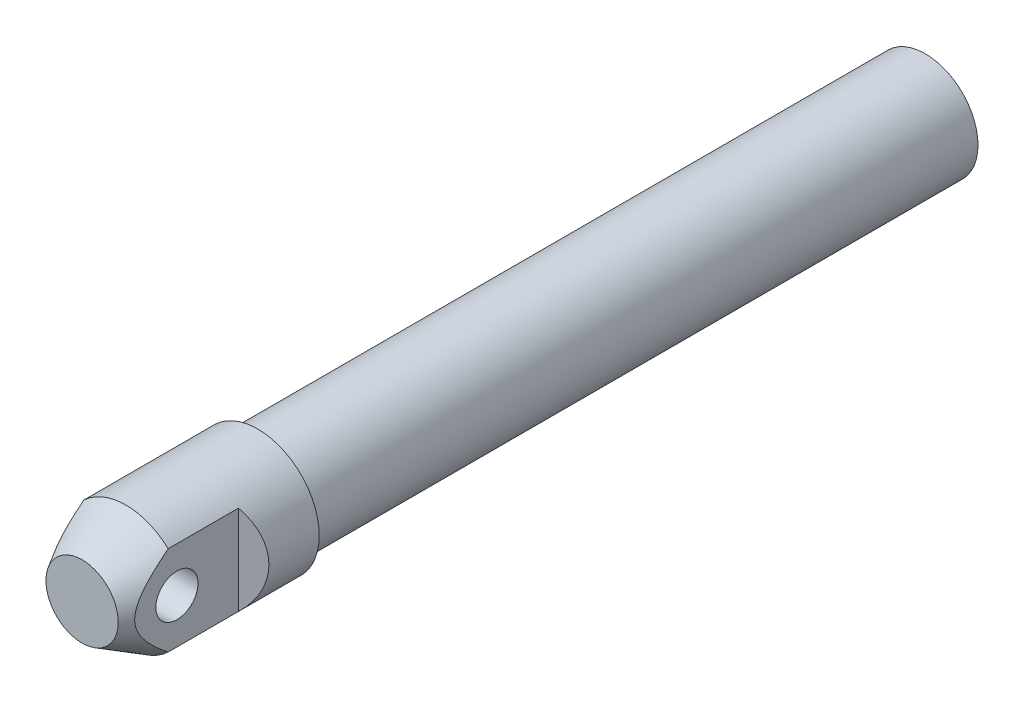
ISO-10303-21;
HEADER;
FILE_DESCRIPTION(('STEP AP214'),'2;1');
FILE_NAME('part.step','',(''),(''),'','','');
FILE_SCHEMA(('AUTOMOTIVE_DESIGN { 1 0 10303 214 1 1 1 1 }'));
ENDSEC;
DATA;
#1=APPLICATION_CONTEXT('core data for automotive mechanical design processes');
#2=APPLICATION_PROTOCOL_DEFINITION('international standard','automotive_design',2000,#1);
#3=PRODUCT_CONTEXT('',#1,'mechanical');
#4=PRODUCT('Part','Part','',(#3));
#5=PRODUCT_RELATED_PRODUCT_CATEGORY('part','',(#4));
#6=PRODUCT_DEFINITION_FORMATION('','',#4);
#7=PRODUCT_DEFINITION_CONTEXT('part definition',#1,'design');
#8=PRODUCT_DEFINITION('design','',#6,#7);
#9=PRODUCT_DEFINITION_SHAPE('','',#8);
#10=(LENGTH_UNIT() NAMED_UNIT(*) SI_UNIT(.MILLI.,.METRE.));
#11=(NAMED_UNIT(*) PLANE_ANGLE_UNIT() SI_UNIT($,.RADIAN.));
#12=(NAMED_UNIT(*) SI_UNIT($,.STERADIAN.) SOLID_ANGLE_UNIT());
#13=UNCERTAINTY_MEASURE_WITH_UNIT(LENGTH_MEASURE(1.E-05),#10,'distance_accuracy_value','');
#14=(GEOMETRIC_REPRESENTATION_CONTEXT(3) GLOBAL_UNCERTAINTY_ASSIGNED_CONTEXT((#13)) GLOBAL_UNIT_ASSIGNED_CONTEXT((#10,
#11,#12)) REPRESENTATION_CONTEXT('',''));
#15=CARTESIAN_POINT('',(0.,0.,0.));
#16=DIRECTION('',(0.,0.,1.));
#17=DIRECTION('',(1.,0.,0.));
#18=AXIS2_PLACEMENT_3D('',#15,#16,#17);
#19=CARTESIAN_POINT('',(0.,0.,20.));
#20=DIRECTION('',(0.,0.,1.));
#21=DIRECTION('',(1.,0.,0.));
#22=AXIS2_PLACEMENT_3D('',#19,#20,#21);
#23=CYLINDRICAL_SURFACE('',#22,3.5);
#24=CARTESIAN_POINT('',(0.,0.,0.));
#25=DIRECTION('',(0.,0.,1.));
#26=DIRECTION('',(1.,0.,0.));
#27=AXIS2_PLACEMENT_3D('',#24,#25,#26);
#28=CIRCLE('',#27,3.5);
#29=CARTESIAN_POINT('',(3.5,0.,0.));
#30=VERTEX_POINT('',#29);
#31=EDGE_CURVE('E82',#30,#30,#28,.T.);
#32=ORIENTED_EDGE('',*,*,#31,.T.);
#33=EDGE_LOOP('',(#32));
#34=FACE_BOUND('',#33,.T.);
#35=CARTESIAN_POINT('',(0.,0.,7.5));
#36=DIRECTION('',(0.,0.,1.));
#37=DIRECTION('',(1.,0.,0.));
#38=AXIS2_PLACEMENT_3D('',#35,#36,#37);
#39=CIRCLE('',#38,3.5);
#40=CARTESIAN_POINT('',(-2.4,-2.5475478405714,7.5));
#41=VERTEX_POINT('',#40);
#42=CARTESIAN_POINT('',(2.4,-2.54754784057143,7.5));
#43=VERTEX_POINT('',#42);
#44=EDGE_CURVE('E67',#41,#43,#39,.T.);
#45=ORIENTED_EDGE('',*,*,#44,.F.);
#46=DIRECTION('',(0.,0.,1.));
#47=VECTOR('',#46,1.);
#48=CARTESIAN_POINT('',(-2.4,-2.5475478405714,20.));
#49=LINE('',#48,#47);
#50=CARTESIAN_POINT('',(-2.4,-2.5475478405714,3.5));
#51=VERTEX_POINT('',#50);
#52=EDGE_CURVE('E30',#41,#51,#49,.F.);
#53=ORIENTED_EDGE('',*,*,#52,.T.);
#54=CARTESIAN_POINT('',(0.,0.,4.8856406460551));
#55=DIRECTION('',(0.5,0.,-0.866025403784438));
#56=DIRECTION('',(0.866025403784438,0.,0.5));
#57=AXIS2_PLACEMENT_3D('',#54,#55,#56);
#58=ELLIPSE('',#57,4.04145188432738,3.5);
#59=CARTESIAN_POINT('',(-2.4,2.5475478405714,3.5));
#60=VERTEX_POINT('',#59);
#61=EDGE_CURVE('E9',#60,#51,#58,.F.);
#62=ORIENTED_EDGE('',*,*,#61,.F.);
#63=DIRECTION('',(0.,0.,1.));
#64=VECTOR('',#63,1.);
#65=CARTESIAN_POINT('',(-2.4,2.5475478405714,20.));
#66=LINE('',#65,#64);
#67=CARTESIAN_POINT('',(-2.4,2.5475478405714,7.5));
#68=VERTEX_POINT('',#67);
#69=EDGE_CURVE('E63',#60,#68,#66,.T.);
#70=ORIENTED_EDGE('',*,*,#69,.T.);
#71=CARTESIAN_POINT('',(2.4,2.5475478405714,7.5));
#72=VERTEX_POINT('',#71);
#73=EDGE_CURVE('E79',#72,#68,#39,.T.);
#74=ORIENTED_EDGE('',*,*,#73,.F.);
#75=DIRECTION('',(0.,0.,1.));
#76=VECTOR('',#75,1.);
#77=CARTESIAN_POINT('',(2.4,2.5475478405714,20.));
#78=LINE('',#77,#76);
#79=CARTESIAN_POINT('',(2.4,2.5475478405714,3.5));
#80=VERTEX_POINT('',#79);
#81=EDGE_CURVE('E38',#80,#72,#78,.T.);
#82=ORIENTED_EDGE('',*,*,#81,.F.);
#83=CARTESIAN_POINT('',(0.,0.,4.8856406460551));
#84=DIRECTION('',(0.5,0.,0.866025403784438));
#85=DIRECTION('',(-0.866025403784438,0.,0.5));
#86=AXIS2_PLACEMENT_3D('',#83,#84,#85);
#87=ELLIPSE('',#86,4.04145188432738,3.5);
#88=CARTESIAN_POINT('',(2.4,-2.5475478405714,3.5));
#89=VERTEX_POINT('',#88);
#90=EDGE_CURVE('E99',#80,#89,#87,.F.);
#91=ORIENTED_EDGE('',*,*,#90,.T.);
#92=DIRECTION('',(0.,0.,1.));
#93=VECTOR('',#92,1.);
#94=CARTESIAN_POINT('',(2.4,-2.5475478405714,20.));
#95=LINE('',#94,#93);
#96=EDGE_CURVE('E74',#43,#89,#95,.F.);
#97=ORIENTED_EDGE('',*,*,#96,.F.);
#98=EDGE_LOOP('',(#45,#53,#62,#70,#74,#82,#91,#97));
#99=FACE_BOUND('',#98,.T.);
#100=ADVANCED_FACE('F14',(#34,#99),#23,.T.);
#101=CARTESIAN_POINT('',(0.,0.,10.));
#102=DIRECTION('',(0.,0.,-1.));
#103=DIRECTION('',(-1.,0.,0.));
#104=AXIS2_PLACEMENT_3D('',#101,#102,#103);
#105=CONICAL_SURFACE('',#104,2.05662432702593,0.523598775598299);
#106=CARTESIAN_POINT('',(0.,0.,10.));
#107=DIRECTION('',(0.,0.,1.));
#108=DIRECTION('',(1.,0.,0.));
#109=AXIS2_PLACEMENT_3D('',#106,#107,#108);
#110=CIRCLE('',#109,2.05662432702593);
#111=CARTESIAN_POINT('',(2.05662432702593,0.,10.));
#112=VERTEX_POINT('',#111);
#113=EDGE_CURVE('E76',#112,#112,#110,.T.);
#114=ORIENTED_EDGE('',*,*,#113,.F.);
#115=EDGE_LOOP('',(#114));
#116=FACE_BOUND('',#115,.T.);
#117=ORIENTED_EDGE('',*,*,#73,.T.);
#118=CARTESIAN_POINT('',(-2.4,-4.81768060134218,4.23961706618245));
#119=CARTESIAN_POINT('',(-2.4,-4.72004912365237,4.39096025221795));
#120=CARTESIAN_POINT('',(-2.4,-4.6220156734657,4.54204602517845));
#121=CARTESIAN_POINT('',(-2.4,-4.42494844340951,4.84357576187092));
#122=CARTESIAN_POINT('',(-2.4,-4.32591460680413,4.99401968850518));
#123=CARTESIAN_POINT('',(-2.4,-4.1264308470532,5.29446856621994));
#124=CARTESIAN_POINT('',(-2.4,-4.02597817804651,5.44447169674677));
#125=CARTESIAN_POINT('',(-2.4,-3.8236209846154,5.74349098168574));
#126=CARTESIAN_POINT('',(-2.4,-3.72171649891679,5.89250716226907));
#127=CARTESIAN_POINT('',(-2.4,-3.5118221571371,6.19548501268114));
#128=CARTESIAN_POINT('',(-2.4,-3.40375575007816,6.34939376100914));
#129=CARTESIAN_POINT('',(-2.4,-3.18514598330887,6.65544071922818));
#130=CARTESIAN_POINT('',(-2.4,-3.07460270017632,6.80757898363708));
#131=CARTESIAN_POINT('',(-2.4,-2.85040204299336,7.10931500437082));
#132=CARTESIAN_POINT('',(-2.4,-2.73674789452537,7.25891514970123));
#133=CARTESIAN_POINT('',(-2.4,-2.50516467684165,7.55475643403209));
#134=CARTESIAN_POINT('',(-2.4,-2.38723638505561,7.70099817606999));
#135=CARTESIAN_POINT('',(-2.4,-2.18301587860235,7.94383982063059));
#136=CARTESIAN_POINT('',(-2.4,-2.09828022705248,8.041744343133));
#137=CARTESIAN_POINT('',(-2.4,-1.92515383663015,8.23438265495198));
#138=CARTESIAN_POINT('',(-2.4,-1.8367612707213,8.3291148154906));
#139=CARTESIAN_POINT('',(-2.4,-1.65588432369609,8.51342585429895));
#140=CARTESIAN_POINT('',(-2.4,-1.56343017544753,8.60303415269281));
#141=CARTESIAN_POINT('',(-2.4,-1.3725369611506,8.775568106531));
#142=CARTESIAN_POINT('',(-2.4,-1.27410421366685,8.85850060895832));
#143=CARTESIAN_POINT('',(-2.4,-1.08897922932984,8.99916544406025));
#144=CARTESIAN_POINT('',(-2.4,-1.00365977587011,9.0586794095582));
#145=CARTESIAN_POINT('',(-2.4,-0.826783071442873,9.16783588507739));
#146=CARTESIAN_POINT('',(-2.4,-0.735228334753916,9.21748234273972));
#147=CARTESIAN_POINT('',(-2.4,-0.558924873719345,9.2961843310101));
#148=CARTESIAN_POINT('',(-2.4,-0.47505855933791,9.32716363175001));
#149=CARTESIAN_POINT('',(-2.4,-0.303337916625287,9.37473972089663));
#150=CARTESIAN_POINT('',(-2.4,-0.21549120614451,9.39136285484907));
#151=CARTESIAN_POINT('',(-2.4,-0.0374387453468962,9.40761469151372));
#152=CARTESIAN_POINT('',(-2.4,0.0527803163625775,9.40710525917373));
#153=CARTESIAN_POINT('',(-2.4,0.231391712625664,9.38884952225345));
#154=CARTESIAN_POINT('',(-2.4,0.3197831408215,9.37109486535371));
#155=CARTESIAN_POINT('',(-2.4,0.513589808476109,9.31512335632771));
#156=CARTESIAN_POINT('',(-2.4,0.617829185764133,9.2729407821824));
#157=CARTESIAN_POINT('',(-2.4,0.76836793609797,9.19821642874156));
#158=CARTESIAN_POINT('',(-2.4,0.817682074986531,9.17132621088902));
#159=CARTESIAN_POINT('',(-2.4,0.914476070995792,9.11441441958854));
#160=CARTESIAN_POINT('',(-2.4,0.961956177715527,9.08439327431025));
#161=CARTESIAN_POINT('',(-2.4,1.07399457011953,9.00921648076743));
#162=CARTESIAN_POINT('',(-2.4,1.13772527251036,8.96283685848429));
#163=CARTESIAN_POINT('',(-2.4,1.26230652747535,8.8663341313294));
#164=CARTESIAN_POINT('',(-2.4,1.32315553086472,8.81620904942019));
#165=CARTESIAN_POINT('',(-2.4,1.44249155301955,8.71302225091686));
#166=CARTESIAN_POINT('',(-2.4,1.50097400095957,8.65995528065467));
#167=CARTESIAN_POINT('',(-2.4,1.61584612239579,8.55159536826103));
#168=CARTESIAN_POINT('',(-2.4,1.67223539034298,8.49630199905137));
#169=CARTESIAN_POINT('',(-2.4,1.8401190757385,8.32643434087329));
#170=CARTESIAN_POINT('',(-2.4,1.94888412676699,8.20916125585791));
#171=CARTESIAN_POINT('',(-2.4,2.10800457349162,8.02988402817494));
#172=CARTESIAN_POINT('',(-2.4,2.16034369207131,7.96960042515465));
#173=CARTESIAN_POINT('',(-2.4,2.26388199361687,7.84806169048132));
#174=CARTESIAN_POINT('',(-2.4,2.31508121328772,7.78680659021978));
#175=CARTESIAN_POINT('',(-2.4,2.4697258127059,7.59877669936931));
#176=CARTESIAN_POINT('',(-2.4,2.57160458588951,7.47071478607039));
#177=CARTESIAN_POINT('',(-2.4,2.77224785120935,7.2121668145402));
#178=CARTESIAN_POINT('',(-2.4,2.871011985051,7.081680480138));
#179=CARTESIAN_POINT('',(-2.4,3.06614071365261,6.81885777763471));
#180=CARTESIAN_POINT('',(-2.4,3.16250443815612,6.68652076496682));
#181=CARTESIAN_POINT('',(-2.4,3.35329484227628,6.42045564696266));
#182=CARTESIAN_POINT('',(-2.4,3.44772146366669,6.28672749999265));
#183=CARTESIAN_POINT('',(-2.4,3.72906864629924,5.88335205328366));
#184=CARTESIAN_POINT('',(-2.4,3.9136472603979,5.61207251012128));
#185=CARTESIAN_POINT('',(-2.4,4.27853103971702,5.06675621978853));
#186=CARTESIAN_POINT('',(-2.4,4.45883710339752,4.79272006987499));
#187=CARTESIAN_POINT('',(-2.4,4.7987680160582,4.26980974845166));
#188=CARTESIAN_POINT('',(-2.4,4.95867811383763,4.02112069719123));
#189=CARTESIAN_POINT('',(-2.4,5.2766230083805,3.52252589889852));
#190=CARTESIAN_POINT('',(-2.4,5.43465768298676,3.27262007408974));
#191=CARTESIAN_POINT('',(-2.4,5.7486354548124,2.77288038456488));
#192=CARTESIAN_POINT('',(-2.4,5.90458436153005,2.52305016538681));
#193=CARTESIAN_POINT('',(-2.4,6.2152929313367,2.02268115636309));
#194=CARTESIAN_POINT('',(-2.4,6.37005269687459,1.77214243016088));
#195=CARTESIAN_POINT('',(-2.4,6.52436486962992,1.52133022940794));
#196=B_SPLINE_CURVE_WITH_KNOTS('',3,(#118,#119,#120,#121,#122,#123,#124,#125,#126,#127,#128,
#129,#130,#131,#132,#133,#134,#135,#136,#137,#138,#139,#140,#141,#142,#143,#144,#145,#146,#147,
#148,#149,#150,#151,#152,#153,#154,#155,#156,#157,#158,#159,#160,#161,#162,#163,#164,#165,#166,
#167,#168,#169,#170,#171,#172,#173,#174,#175,#176,#177,#178,#179,#180,#181,#182,#183,#184,#185,
#186,#187,#188,#189,#190,#191,#192,#193,#194,#195),.UNSPECIFIED.,.F.,.F.,(4,2,2,2,2,2,2,2,2,2,2,
2,2,2,2,2,2,2,2,2,2,2,2,2,2,2,2,2,2,2,2,2,2,2,2,2,2,2,4),(0.,0.540307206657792,1.08064523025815,
1.62223321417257,2.16380677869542,2.72796581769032,3.29210743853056,3.85568475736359,
4.41916007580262,4.80754000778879,5.19611637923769,5.58217431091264,5.96783110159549,
6.27946641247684,6.59097679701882,6.8582080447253,7.12494783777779,7.39383879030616,
7.66286003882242,7.99820889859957,8.16664490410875,8.33505790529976,8.57133254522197,
8.80773279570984,9.04456973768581,9.28145232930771,9.76101487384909,10.0005123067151,
10.2400020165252,10.7308602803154,11.2217748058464,11.7128647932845,12.2039695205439,
13.1882562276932,14.1723340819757,15.0593163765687,15.9463561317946,16.8298778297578,
17.7133225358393),.UNSPECIFIED.);
#197=EDGE_CURVE('E23',#68,#41,#196,.F.);
#198=ORIENTED_EDGE('',*,*,#197,.T.);
#199=ORIENTED_EDGE('',*,*,#44,.T.);
#200=CARTESIAN_POINT('',(2.4,-4.81768060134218,4.23961706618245));
#201=CARTESIAN_POINT('',(2.4,-4.72004912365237,4.39096025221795));
#202=CARTESIAN_POINT('',(2.4,-4.6220156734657,4.54204602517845));
#203=CARTESIAN_POINT('',(2.4,-4.42494844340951,4.84357576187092));
#204=CARTESIAN_POINT('',(2.4,-4.32591460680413,4.99401968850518));
#205=CARTESIAN_POINT('',(2.4,-4.1264308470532,5.29446856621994));
#206=CARTESIAN_POINT('',(2.4,-4.02597817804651,5.44447169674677));
#207=CARTESIAN_POINT('',(2.4,-3.8236209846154,5.74349098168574));
#208=CARTESIAN_POINT('',(2.4,-3.72171649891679,5.89250716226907));
#209=CARTESIAN_POINT('',(2.4,-3.5118221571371,6.19548501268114));
#210=CARTESIAN_POINT('',(2.4,-3.40375575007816,6.34939376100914));
#211=CARTESIAN_POINT('',(2.4,-3.18514598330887,6.65544071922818));
#212=CARTESIAN_POINT('',(2.4,-3.07460270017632,6.80757898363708));
#213=CARTESIAN_POINT('',(2.4,-2.85040204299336,7.10931500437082));
#214=CARTESIAN_POINT('',(2.4,-2.73674789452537,7.25891514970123));
#215=CARTESIAN_POINT('',(2.4,-2.50516467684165,7.55475643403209));
#216=CARTESIAN_POINT('',(2.4,-2.38723638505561,7.70099817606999));
#217=CARTESIAN_POINT('',(2.4,-2.18301587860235,7.94383982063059));
#218=CARTESIAN_POINT('',(2.4,-2.09828022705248,8.041744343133));
#219=CARTESIAN_POINT('',(2.4,-1.92515383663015,8.23438265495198));
#220=CARTESIAN_POINT('',(2.4,-1.8367612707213,8.3291148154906));
#221=CARTESIAN_POINT('',(2.4,-1.65588432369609,8.51342585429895));
#222=CARTESIAN_POINT('',(2.4,-1.56343017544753,8.60303415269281));
#223=CARTESIAN_POINT('',(2.4,-1.3725369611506,8.775568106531));
#224=CARTESIAN_POINT('',(2.4,-1.27410421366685,8.85850060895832));
#225=CARTESIAN_POINT('',(2.4,-1.08897922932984,8.99916544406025));
#226=CARTESIAN_POINT('',(2.4,-1.00365977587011,9.0586794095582));
#227=CARTESIAN_POINT('',(2.4,-0.826783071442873,9.16783588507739));
#228=CARTESIAN_POINT('',(2.4,-0.735228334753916,9.21748234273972));
#229=CARTESIAN_POINT('',(2.4,-0.558924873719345,9.2961843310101));
#230=CARTESIAN_POINT('',(2.4,-0.47505855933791,9.32716363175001));
#231=CARTESIAN_POINT('',(2.4,-0.303337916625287,9.37473972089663));
#232=CARTESIAN_POINT('',(2.4,-0.21549120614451,9.39136285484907));
#233=CARTESIAN_POINT('',(2.4,-0.0374387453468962,9.40761469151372));
#234=CARTESIAN_POINT('',(2.4,0.0527803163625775,9.40710525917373));
#235=CARTESIAN_POINT('',(2.4,0.231391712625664,9.38884952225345));
#236=CARTESIAN_POINT('',(2.4,0.3197831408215,9.37109486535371));
#237=CARTESIAN_POINT('',(2.4,0.513589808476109,9.31512335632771));
#238=CARTESIAN_POINT('',(2.4,0.617829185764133,9.2729407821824));
#239=CARTESIAN_POINT('',(2.4,0.76836793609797,9.19821642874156));
#240=CARTESIAN_POINT('',(2.4,0.817682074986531,9.17132621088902));
#241=CARTESIAN_POINT('',(2.4,0.914476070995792,9.11441441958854));
#242=CARTESIAN_POINT('',(2.4,0.961956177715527,9.08439327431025));
#243=CARTESIAN_POINT('',(2.4,1.07399457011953,9.00921648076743));
#244=CARTESIAN_POINT('',(2.4,1.13772527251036,8.96283685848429));
#245=CARTESIAN_POINT('',(2.4,1.26230652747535,8.8663341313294));
#246=CARTESIAN_POINT('',(2.4,1.32315553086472,8.81620904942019));
#247=CARTESIAN_POINT('',(2.4,1.44249155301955,8.71302225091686));
#248=CARTESIAN_POINT('',(2.4,1.50097400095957,8.65995528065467));
#249=CARTESIAN_POINT('',(2.4,1.61584612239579,8.55159536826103));
#250=CARTESIAN_POINT('',(2.4,1.67223539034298,8.49630199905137));
#251=CARTESIAN_POINT('',(2.4,1.8401190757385,8.32643434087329));
#252=CARTESIAN_POINT('',(2.4,1.94888412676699,8.20916125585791));
#253=CARTESIAN_POINT('',(2.4,2.10800457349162,8.02988402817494));
#254=CARTESIAN_POINT('',(2.4,2.16034369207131,7.96960042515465));
#255=CARTESIAN_POINT('',(2.4,2.26388199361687,7.84806169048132));
#256=CARTESIAN_POINT('',(2.4,2.31508121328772,7.78680659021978));
#257=CARTESIAN_POINT('',(2.4,2.4697258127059,7.59877669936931));
#258=CARTESIAN_POINT('',(2.4,2.57160458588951,7.47071478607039));
#259=CARTESIAN_POINT('',(2.4,2.77224785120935,7.2121668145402));
#260=CARTESIAN_POINT('',(2.4,2.871011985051,7.081680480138));
#261=CARTESIAN_POINT('',(2.4,3.06614071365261,6.81885777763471));
#262=CARTESIAN_POINT('',(2.4,3.16250443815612,6.68652076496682));
#263=CARTESIAN_POINT('',(2.4,3.35329484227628,6.42045564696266));
#264=CARTESIAN_POINT('',(2.4,3.44772146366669,6.28672749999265));
#265=CARTESIAN_POINT('',(2.4,3.72906864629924,5.88335205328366));
#266=CARTESIAN_POINT('',(2.4,3.9136472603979,5.61207251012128));
#267=CARTESIAN_POINT('',(2.4,4.27853103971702,5.06675621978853));
#268=CARTESIAN_POINT('',(2.4,4.45883710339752,4.79272006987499));
#269=CARTESIAN_POINT('',(2.4,4.7987680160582,4.26980974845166));
#270=CARTESIAN_POINT('',(2.4,4.95867811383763,4.02112069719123));
#271=CARTESIAN_POINT('',(2.4,5.2766230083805,3.52252589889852));
#272=CARTESIAN_POINT('',(2.4,5.43465768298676,3.27262007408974));
#273=CARTESIAN_POINT('',(2.4,5.7486354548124,2.77288038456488));
#274=CARTESIAN_POINT('',(2.4,5.90458436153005,2.52305016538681));
#275=CARTESIAN_POINT('',(2.4,6.2152929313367,2.02268115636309));
#276=CARTESIAN_POINT('',(2.4,6.37005269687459,1.77214243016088));
#277=CARTESIAN_POINT('',(2.4,6.52436486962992,1.52133022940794));
#278=B_SPLINE_CURVE_WITH_KNOTS('',3,(#200,#201,#202,#203,#204,#205,#206,#207,#208,#209,#210,
#211,#212,#213,#214,#215,#216,#217,#218,#219,#220,#221,#222,#223,#224,#225,#226,#227,#228,#229,
#230,#231,#232,#233,#234,#235,#236,#237,#238,#239,#240,#241,#242,#243,#244,#245,#246,#247,#248,
#249,#250,#251,#252,#253,#254,#255,#256,#257,#258,#259,#260,#261,#262,#263,#264,#265,#266,#267,
#268,#269,#270,#271,#272,#273,#274,#275,#276,#277),.UNSPECIFIED.,.F.,.F.,(4,2,2,2,2,2,2,2,2,2,2,
2,2,2,2,2,2,2,2,2,2,2,2,2,2,2,2,2,2,2,2,2,2,2,2,2,2,2,4),(0.,0.540307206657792,1.08064523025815,
1.62223321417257,2.16380677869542,2.72796581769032,3.29210743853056,3.85568475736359,
4.41916007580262,4.80754000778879,5.19611637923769,5.58217431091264,5.96783110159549,
6.27946641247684,6.59097679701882,6.8582080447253,7.12494783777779,7.39383879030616,
7.66286003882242,7.99820889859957,8.16664490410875,8.33505790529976,8.57133254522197,
8.80773279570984,9.04456973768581,9.28145232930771,9.76101487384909,10.0005123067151,
10.2400020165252,10.7308602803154,11.2217748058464,11.7128647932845,12.2039695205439,
13.1882562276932,14.1723340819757,15.0593163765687,15.9463561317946,16.8298778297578,
17.7133225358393),.UNSPECIFIED.);
#279=EDGE_CURVE('E91',#72,#43,#278,.F.);
#280=ORIENTED_EDGE('',*,*,#279,.F.);
#281=EDGE_LOOP('',(#117,#198,#199,#280));
#282=FACE_BOUND('',#281,.T.);
#283=ADVANCED_FACE('F104',(#116,#282),#105,.T.);
#284=CARTESIAN_POINT('',(0.,2.05662432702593,10.));
#285=DIRECTION('',(0.,0.,-1.));
#286=DIRECTION('',(-1.,0.,0.));
#287=AXIS2_PLACEMENT_3D('',#284,#285,#286);
#288=PLANE('',#287);
#289=ORIENTED_EDGE('',*,*,#113,.T.);
#290=EDGE_LOOP('',(#289));
#291=FACE_BOUND('',#290,.T.);
#292=ADVANCED_FACE('F16',(#291),#288,.F.);
#293=CARTESIAN_POINT('',(0.,3.,-38.));
#294=DIRECTION('',(0.,0.,-1.));
#295=DIRECTION('',(-1.,0.,0.));
#296=AXIS2_PLACEMENT_3D('',#293,#294,#295);
#297=PLANE('',#296);
#298=CARTESIAN_POINT('',(0.,0.,-38.));
#299=DIRECTION('',(0.,0.,1.));
#300=DIRECTION('',(1.,0.,0.));
#301=AXIS2_PLACEMENT_3D('',#298,#299,#300);
#302=CIRCLE('',#301,3.);
#303=CARTESIAN_POINT('',(3.,0.,-38.));
#304=VERTEX_POINT('',#303);
#305=EDGE_CURVE('E88',#304,#304,#302,.T.);
#306=ORIENTED_EDGE('',*,*,#305,.F.);
#307=EDGE_LOOP('',(#306));
#308=FACE_BOUND('',#307,.T.);
#309=ADVANCED_FACE('F147',(#308),#297,.T.);
#310=CARTESIAN_POINT('',(0.,0.,20.));
#311=DIRECTION('',(0.,0.,1.));
#312=DIRECTION('',(1.,0.,0.));
#313=AXIS2_PLACEMENT_3D('',#310,#311,#312);
#314=CYLINDRICAL_SURFACE('',#313,3.);
#315=ORIENTED_EDGE('',*,*,#305,.T.);
#316=EDGE_LOOP('',(#315));
#317=FACE_BOUND('',#316,.T.);
#318=CARTESIAN_POINT('',(0.,0.,0.));
#319=DIRECTION('',(0.,0.,1.));
#320=DIRECTION('',(1.,0.,0.));
#321=AXIS2_PLACEMENT_3D('',#318,#319,#320);
#322=CIRCLE('',#321,3.);
#323=CARTESIAN_POINT('',(3.,0.,0.));
#324=VERTEX_POINT('',#323);
#325=EDGE_CURVE('E85',#324,#324,#322,.T.);
#326=ORIENTED_EDGE('',*,*,#325,.F.);
#327=EDGE_LOOP('',(#326));
#328=FACE_BOUND('',#327,.T.);
#329=ADVANCED_FACE('F134',(#317,#328),#314,.T.);
#330=CARTESIAN_POINT('',(0.,3.,0.));
#331=DIRECTION('',(0.,0.,1.));
#332=DIRECTION('',(1.,0.,0.));
#333=AXIS2_PLACEMENT_3D('',#330,#331,#332);
#334=PLANE('',#333);
#335=ORIENTED_EDGE('',*,*,#31,.F.);
#336=EDGE_LOOP('',(#335));
#337=FACE_BOUND('',#336,.T.);
#338=ORIENTED_EDGE('',*,*,#325,.T.);
#339=EDGE_LOOP('',(#338));
#340=FACE_BOUND('',#339,.T.);
#341=ADVANCED_FACE('F125',(#337,#340),#334,.F.);
#342=CARTESIAN_POINT('',(2.4,-15.,3.5));
#343=DIRECTION('',(0.5,0.,0.866025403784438));
#344=DIRECTION('',(0.866025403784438,0.,-0.5));
#345=AXIS2_PLACEMENT_3D('',#342,#343,#344);
#346=PLANE('',#345);
#347=DIRECTION('',(0.,1.,0.));
#348=VECTOR('',#347,1.);
#349=CARTESIAN_POINT('',(2.4,-15.,3.5));
#350=LINE('',#349,#348);
#351=EDGE_CURVE('E68',#89,#80,#350,.T.);
#352=ORIENTED_EDGE('',*,*,#351,.F.);
#353=ORIENTED_EDGE('',*,*,#90,.F.);
#354=EDGE_LOOP('',(#352,#353));
#355=FACE_BOUND('',#354,.T.);
#356=ADVANCED_FACE('F123',(#355),#346,.T.);
#357=CARTESIAN_POINT('',(2.4,-15.,3.5));
#358=DIRECTION('',(-1.,0.,0.));
#359=DIRECTION('',(0.,0.,1.));
#360=AXIS2_PLACEMENT_3D('',#357,#358,#359);
#361=PLANE('',#360);
#362=CARTESIAN_POINT('',(2.4,0.,7.));
#363=DIRECTION('',(1.,0.,0.));
#364=DIRECTION('',(0.,0.,-1.));
#365=AXIS2_PLACEMENT_3D('',#362,#363,#364);
#366=CIRCLE('',#365,1.2);
#367=CARTESIAN_POINT('',(2.4,0.,5.8));
#368=VERTEX_POINT('',#367);
#369=EDGE_CURVE('E233',#368,#368,#366,.T.);
#370=ORIENTED_EDGE('',*,*,#369,.F.);
#371=EDGE_LOOP('',(#370));
#372=FACE_BOUND('',#371,.T.);
#373=ORIENTED_EDGE('',*,*,#96,.T.);
#374=ORIENTED_EDGE('',*,*,#351,.T.);
#375=ORIENTED_EDGE('',*,*,#81,.T.);
#376=ORIENTED_EDGE('',*,*,#279,.T.);
#377=EDGE_LOOP('',(#373,#374,#375,#376));
#378=FACE_BOUND('',#377,.T.);
#379=ADVANCED_FACE('F101',(#372,#378),#361,.F.);
#380=CARTESIAN_POINT('',(-2.4,-15.,3.5));
#381=DIRECTION('',(-1.,0.,0.));
#382=DIRECTION('',(0.,0.,1.));
#383=AXIS2_PLACEMENT_3D('',#380,#381,#382);
#384=PLANE('',#383);
#385=CARTESIAN_POINT('',(-2.4,0.,7.));
#386=DIRECTION('',(-1.,0.,0.));
#387=DIRECTION('',(0.,0.,1.));
#388=AXIS2_PLACEMENT_3D('',#385,#386,#387);
#389=CIRCLE('',#388,1.2);
#390=CARTESIAN_POINT('',(-2.4,0.,8.2));
#391=VERTEX_POINT('',#390);
#392=EDGE_CURVE('E18',#391,#391,#389,.T.);
#393=ORIENTED_EDGE('',*,*,#392,.F.);
#394=EDGE_LOOP('',(#393));
#395=FACE_BOUND('',#394,.T.);
#396=ORIENTED_EDGE('',*,*,#197,.F.);
#397=ORIENTED_EDGE('',*,*,#69,.F.);
#398=DIRECTION('',(0.,1.,0.));
#399=VECTOR('',#398,1.);
#400=CARTESIAN_POINT('',(-2.4,-15.,3.5));
#401=LINE('',#400,#399);
#402=EDGE_CURVE('E59',#51,#60,#401,.T.);
#403=ORIENTED_EDGE('',*,*,#402,.F.);
#404=ORIENTED_EDGE('',*,*,#52,.F.);
#405=EDGE_LOOP('',(#396,#397,#403,#404));
#406=FACE_BOUND('',#405,.T.);
#407=ADVANCED_FACE('F62',(#395,#406),#384,.T.);
#408=CARTESIAN_POINT('',(-2.4,-15.,3.5));
#409=DIRECTION('',(0.5,0.,-0.866025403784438));
#410=DIRECTION('',(-0.866025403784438,0.,-0.5));
#411=AXIS2_PLACEMENT_3D('',#408,#409,#410);
#412=PLANE('',#411);
#413=ORIENTED_EDGE('',*,*,#61,.T.);
#414=ORIENTED_EDGE('',*,*,#402,.T.);
#415=EDGE_LOOP('',(#413,#414));
#416=FACE_BOUND('',#415,.T.);
#417=ADVANCED_FACE('F58',(#416),#412,.F.);
#418=CARTESIAN_POINT('',(-3.5,0.,7.));
#419=DIRECTION('',(1.,0.,0.));
#420=DIRECTION('',(0.,0.,-1.));
#421=AXIS2_PLACEMENT_3D('',#418,#419,#420);
#422=CYLINDRICAL_SURFACE('',#421,1.2);
#423=ORIENTED_EDGE('',*,*,#392,.T.);
#424=EDGE_LOOP('',(#423));
#425=FACE_BOUND('',#424,.T.);
#426=ORIENTED_EDGE('',*,*,#369,.T.);
#427=EDGE_LOOP('',(#426));
#428=FACE_BOUND('',#427,.T.);
#429=ADVANCED_FACE('F121',(#425,#428),#422,.F.);
#430=CLOSED_SHELL('',(#100,#283,#292,#309,#329,#341,#356,#379,#407,#417,#429));
#431=MANIFOLD_SOLID_BREP('B1',#430);
#432=ADVANCED_BREP_SHAPE_REPRESENTATION('',(#18,#431),#14);
#433=SHAPE_DEFINITION_REPRESENTATION(#9,#432);
ENDSEC;
END-ISO-10303-21;
